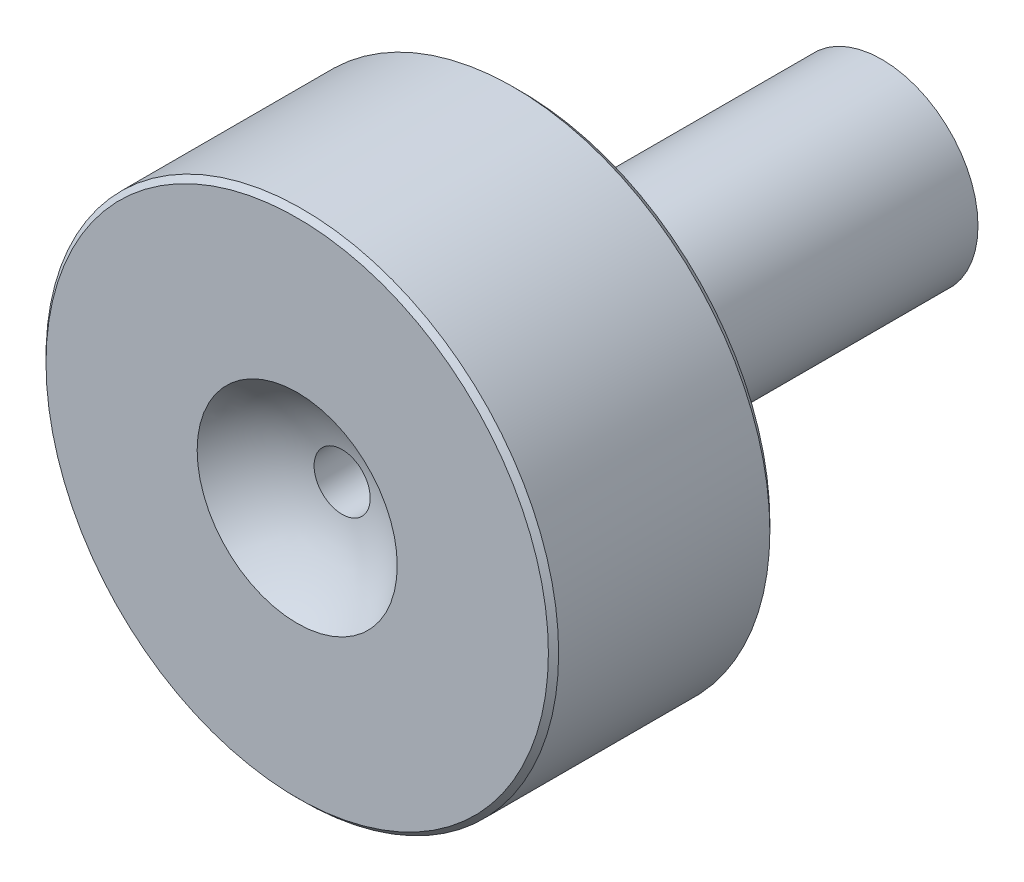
from build123d import *

# Parameters (mm, degrees)
HEAD_PV_R     = 25.4
HEAD_DEPTH    = 22.225
BODY_PV_R     = 9.525
BODY_DEPTH    = 35.7124
FILLET1_R     = 3.175
CHAMFER1_SIZE = 0.7874
CHAMFER2_SIZE = 0.508


with BuildPart() as part:
    # Head PV → Head (new body)
    with BuildSketch(Plane.XY):
        Circle(HEAD_PV_R)
    extrude(amount=HEAD_DEPTH)

    # Body PV → Body (add)
    with BuildSketch(Plane(origin=(0, 0, 0), x_dir=(-1, 0, 0), z_dir=(0, 0, -1))):
        Circle(BODY_PV_R)
    extrude(amount=BODY_DEPTH)

    # ID FV → Sprue Hole (revolve, cut)
    with BuildSketch(Plane(origin=(0, 0, 0), x_dir=(1, 0, 0), z_dir=(0, 1, 0))):
        with BuildLine():
            Line((9.913934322, -22.225), (0, -22.225))
            Line((0, -22.225), (0, 35.7124))
            Line((0, 35.7124), (3.896943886, 35.7124))
            Line((3.896943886, 35.7124), (2.7813, -17.770794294))
            ThreePointArc((2.7813, -17.770794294), (6.726977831, -19.390417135), (9.913934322, -22.225))
        make_face()
    revolve(axis=Axis((0, 0, 22.225), (0, 0, 1)), mode=Mode.SUBTRACT)

    # Fillet1
    fillet1_edges = [part.edges().sort_by_distance(p)[0] for p in [
        (9.525, 0, 0),
    ]]
    fillet(fillet1_edges, radius=FILLET1_R)

    # Chamfer1
    chamfer1_edges = [part.edges().sort_by_distance(p)[0] for p in [
        (-25.4, 0, 0),
    ]]
    chamfer(chamfer1_edges, length=CHAMFER1_SIZE)

    # Chamfer2
    chamfer2_edges = [part.edges().sort_by_distance(p)[0] for p in [
        (-25.4, 0, 22.225),
    ]]
    chamfer(chamfer2_edges, length=CHAMFER2_SIZE)


solid = part.part
